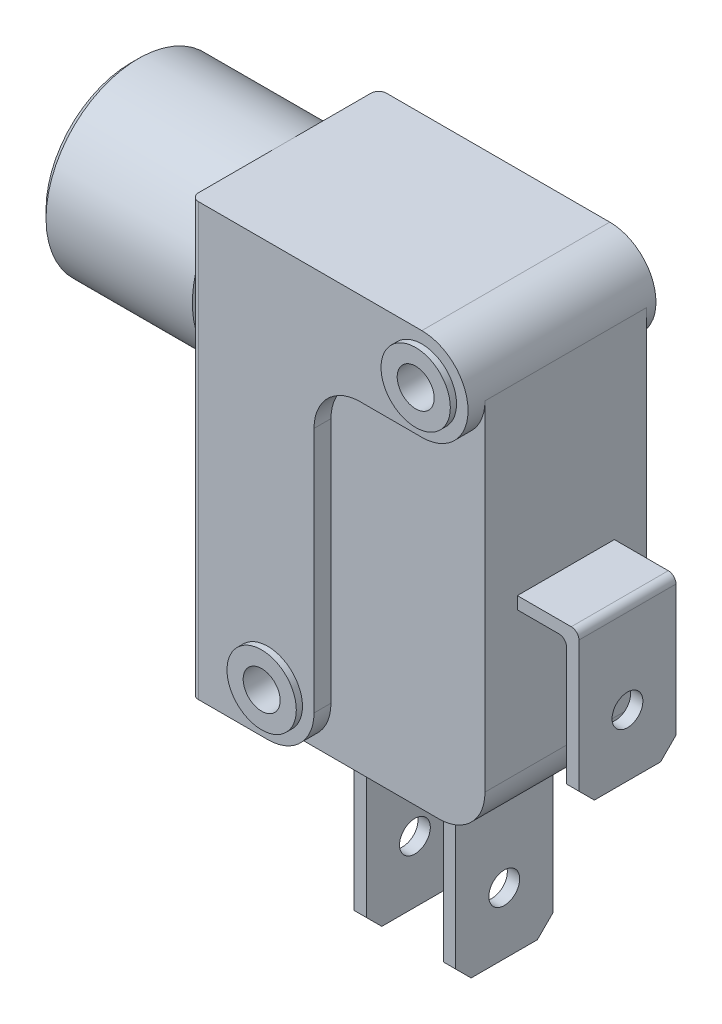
from build123d import *

# Parameters (mm, degrees)
AUFSATZ_LINEAR_AUSTRAGEN1_DEPTH = 13
SCHNITT_LINEAR_START            = -13
SCHNITT_LINEAR_AUSTRAGEN1_DEPTH = 13
SKIZZE3_R                       = 1.2
SCHNITT_LINEAR_AUSTRAGEN2_DEPTH = 13
AUFSATZ_LINEAR_START            = -1.5
AUFSATZ_LINEAR_AUSTRAGEN2_DEPTH = 10.5
VERRUNDUNG1_R                   = 3
SKIZZE6_W                       = 19.71093517
SKIZZE6_H                       = 28.166538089
SKIZZE6_R                       = 2.25
SCHNITT_LINEAR_AUSTRAGEN4_DEPTH = 0.4
SCHNITT_LINEAR_START_2          = -0.4
SKIZZE7_W                       = 21.157153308
SKIZZE7_H                       = 35.133064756
SKIZZE7_R                       = 2.25
SCHNITT_LINEAR_AUSTRAGEN5_DEPTH = 0.4
VERRUNDUNG2_R                   = 3
VERRUNDUNG3_R                   = 0.5
VERRUNDUNG4_R                   = 0.5
SKIZZE8_R                       = 6
AUFSATZ_LINEAR_AUSTRAGEN4_DEPTH = 10
FASE1_SIZE                      = 0.5
SKIZZE9_R                       = 4
SCHNITT_LINEAR_AUSTRAGEN6_DEPTH = 10
AUFSATZ_LINEAR_START_2          = -2.1
SKIZZE10_W                      = 3.2
SKIZZE10_H                      = 0.8
SKIZZE10_W_2                    = 0.8
SKIZZE10_H_2                    = 9.2
SKIZZE10_H_3                    = 11
AUFSATZ_LINEAR_AUSTRAGEN5_DEPTH = 6.3
FASE2_SIZE                      = 1
SCHNITT_LINEAR_AUSTRAGEN7_REACH = 46.463
SKIZZE11_R                      = 1
SKIZZE12_R                      = 1
SCHNITT_LINEAR_AUSTRAGEN8_DEPTH = 10
VERRUNDUNG5_R                   = 0.5
VERRUNDUNG6_R                   = 0.5


with BuildPart() as part:
    # Skizze1 → Aufsatz-Linear austragen1 (new body)
    with BuildSketch(Plane.XY):
        with BuildLine():
            Line((0, 0), (14, 0))
            ThreePointArc((14, 0), (16.828427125, 1.171572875), (18, 4))
            Line((18, 4), (18, 28))
            Line((18, 28), (0, 28))
            Line((0, 28), (0, 0))
        make_face()
    extrude(amount=AUFSATZ_LINEAR_AUSTRAGEN1_DEPTH)

    # Skizze2 → Schnitt-Linear austragen1 (cut)
    with BuildSketch(Plane.XY.offset(13).offset(SCHNITT_LINEAR_START)):
        with BuildLine():
            ThreePointArc((18, 25), (17.121320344, 22.878679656), (15, 22))
            Line((15, 22), (8, 22))
            Line((8, 22), (8, 3))
            ThreePointArc((8, 3), (7.121320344, 0.878679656), (5, 0))
            Line((5, 0), (8, 0))
            Line((8, 0), (14, 0))
            ThreePointArc((14, 0), (16.828427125, 1.171572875), (18, 4))
            Line((18, 4), (18, 25))
        make_face()
        with BuildLine():
            Line((18, 28), (18, 25))
            Line((18, 25), (18, 4))
            ThreePointArc((18, 4), (16.828427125, 1.171572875), (14, 0))
            Line((14, 0), (22.121460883, 0))
            Line((22.121460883, 0), (22.121460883, 30.705344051))
            Line((22.121460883, 30.705344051), (8, 30.705344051))
            Line((8, 30.705344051), (8, 28))
            Line((8, 28), (15, 28))
            Line((15, 28), (18, 28))
        make_face()
        with BuildLine():
            ThreePointArc((15, 28), (17.121320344, 27.121320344), (18, 25))
            Line((18, 25), (18, 28))
            Line((18, 28), (15, 28))
        make_face()
    extrude(amount=SCHNITT_LINEAR_AUSTRAGEN1_DEPTH, mode=Mode.SUBTRACT)

    # Skizze3 → Schnitt-Linear austragen2 (cut)
    with BuildSketch(Plane.XY.offset(13)):
        with Locations((15, 25)):
            Circle(SKIZZE3_R)
        with Locations((5, 3)):
            Circle(SKIZZE3_R)
    extrude(amount=-SCHNITT_LINEAR_AUSTRAGEN2_DEPTH, mode=Mode.SUBTRACT)

    # Skizze4 → Aufsatz-Linear austragen2 (add)
    with BuildSketch(Plane.XY.offset(13).offset(AUFSATZ_LINEAR_START)):
        Polygon((5, 0), (18, 0), (18, 25), (16.622446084, 25), (16.622446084, 23.216563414), (6.837863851, 23.216563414), (6.837863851, 1.375323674), (5, 1.375323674), align=None)
    extrude(amount=-AUFSATZ_LINEAR_AUSTRAGEN2_DEPTH)

    # Verrundung1
    verrundung1_edges = [part.edges().sort_by_distance(p)[0] for p in [
        (8, 22, 0.5),
        (8, 22, 12.25),
    ]]
    fillet(verrundung1_edges, radius=VERRUNDUNG1_R)

    # Skizze6 → Schnitt-Linear austragen4 (cut)
    with BuildSketch(Plane.XY.offset(13)):
        with Locations((9.855467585, 14.083269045)):
            Rectangle(SKIZZE6_W, SKIZZE6_H)
        with Locations((15, 25)):
            Circle(SKIZZE6_R, mode=Mode.SUBTRACT)
        with Locations((5, 3)):
            Circle(SKIZZE6_R, mode=Mode.SUBTRACT)
    extrude(amount=-SCHNITT_LINEAR_AUSTRAGEN4_DEPTH, mode=Mode.SUBTRACT)

    # Skizze7 → Schnitt-Linear austragen5 (cut)
    with BuildSketch(Plane(origin=(0, 0, 0), x_dir=(-1, 0, 0), z_dir=(0, 0, -1)).offset(SCHNITT_LINEAR_START_2)):
        with Locations((-10.578576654, 17.566532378)):
            Rectangle(SKIZZE7_W, SKIZZE7_H)
        with Locations(Location((-15, 25, 0), (0, 0, 180))):
            Circle(SKIZZE7_R, mode=Mode.SUBTRACT)
        with Locations(Location((-5, 3, 0), (0, 0, 180))):
            Circle(SKIZZE7_R, mode=Mode.SUBTRACT)
    extrude(amount=SCHNITT_LINEAR_AUSTRAGEN5_DEPTH, mode=Mode.SUBTRACT)

    # Verrundung2
    verrundung2_edges = [part.edges().sort_by_distance(p)[0] for p in [
        (18, 0, 6.25),
    ]]
    fillet(verrundung2_edges, radius=VERRUNDUNG2_R)

    # Verrundung3
    verrundung3_edges = [part.edges().sort_by_distance(p)[0] for p in [
        (0, 14, 0.4),
    ]]
    fillet(verrundung3_edges, radius=VERRUNDUNG3_R)

    # Verrundung4
    verrundung4_edges = [part.edges().sort_by_distance(p)[0] for p in [
        (0, 14, 12.6),
    ]]
    fillet(verrundung4_edges, radius=VERRUNDUNG4_R)

    # Skizze8 → Aufsatz-Linear austragen4 (add)
    with BuildSketch(Plane.ZY):
        with Locations(Location((6.5, 22, 0), (0, 0, 158.960530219))):
            Circle(SKIZZE8_R)
    extrude(amount=AUFSATZ_LINEAR_AUSTRAGEN4_DEPTH)

    # Fase1
    fase1_edges = [part.edges().sort_by_distance(p)[0] for p in [
        (-10, 19.845934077, 12.1),
    ]]
    chamfer(fase1_edges, length=FASE1_SIZE)

    # Skizze9 → Schnitt-Linear austragen6 (cut)
    with BuildSketch(Plane.ZY.offset(10)):
        with Locations((6.5, 22)):
            Circle(SKIZZE9_R)
    extrude(amount=-SCHNITT_LINEAR_AUSTRAGEN6_DEPTH, mode=Mode.SUBTRACT)

    # Skizze10 → Aufsatz-Linear austragen5 (add)
    with BuildSketch(Plane.XY.offset(11.5).offset(AUFSATZ_LINEAR_START_2)):
        with Locations((19.6, 12.6)):
            Rectangle(SKIZZE10_W, SKIZZE10_H)
        with Locations((21.6, 12.6)):
            Rectangle(SKIZZE10_W_2, SKIZZE10_H)
        with Locations((21.6, 7.6)):
            Rectangle(SKIZZE10_W_2, SKIZZE10_H_2)
        with Locations((7.8, -5.5)):
            Rectangle(SKIZZE10_W_2, SKIZZE10_H_3)
        with Locations((13.6, -5.5)):
            Rectangle(SKIZZE10_W_2, SKIZZE10_H_3)
    extrude(amount=-AUFSATZ_LINEAR_AUSTRAGEN5_DEPTH)

    # Fase2
    fase2_edges = [part.edges().sort_by_distance(p)[0] for p in [
        (21.6, 3, 9.4),
        (21.6, 3, 3.1),
        (7.8, -11, 9.4),
        (7.8, -11, 3.1),
        (13.6, -11, 9.4),
        (13.6, -11, 3.1),
    ]]
    chamfer(fase2_edges, length=FASE2_SIZE)

    # Skizze11 → Schnitt-Linear austragen7 (cut, up to next)
    with BuildSketch(Plane(origin=(22, 0, 0), x_dir=(0, 0, -1), z_dir=(1, 0, 0)), mode=Mode.PRIVATE) as schnitt_linear_austragen7_sk1:
        with Locations(Location((-6.25, 7, 0), (0, 0, 90))):
            Circle(SKIZZE11_R)
    schnitt_linear_austragen7_tool1 = extrude(schnitt_linear_austragen7_sk1.sketch, amount=-SCHNITT_LINEAR_AUSTRAGEN7_REACH, mode=Mode.PRIVATE) & part.part
    add(schnitt_linear_austragen7_tool1.solids().sort_by_distance((22, 7, 6.25))[0], mode=Mode.SUBTRACT)

    # Skizze12 → Schnitt-Linear austragen8 (cut)
    with BuildSketch(Plane(origin=(14, 0, 0), x_dir=(0, 0, -1), z_dir=(1, 0, 0))):
        with Locations(Location((-6.25, -7, 0), (0, 0, 90))):
            Circle(SKIZZE12_R)
    extrude(amount=-SCHNITT_LINEAR_AUSTRAGEN8_DEPTH, mode=Mode.SUBTRACT)

    # Verrundung5
    verrundung5_edges = [part.edges().sort_by_distance(p)[0] for p in [
        (22, 13, 6.25),
    ]]
    fillet(verrundung5_edges, radius=VERRUNDUNG5_R)

    # Verrundung6
    verrundung6_edges = [part.edges().sort_by_distance(p)[0] for p in [
        (21.2, 12.2, 6.25),
    ]]
    fillet(verrundung6_edges, radius=VERRUNDUNG6_R)


solid = part.part
